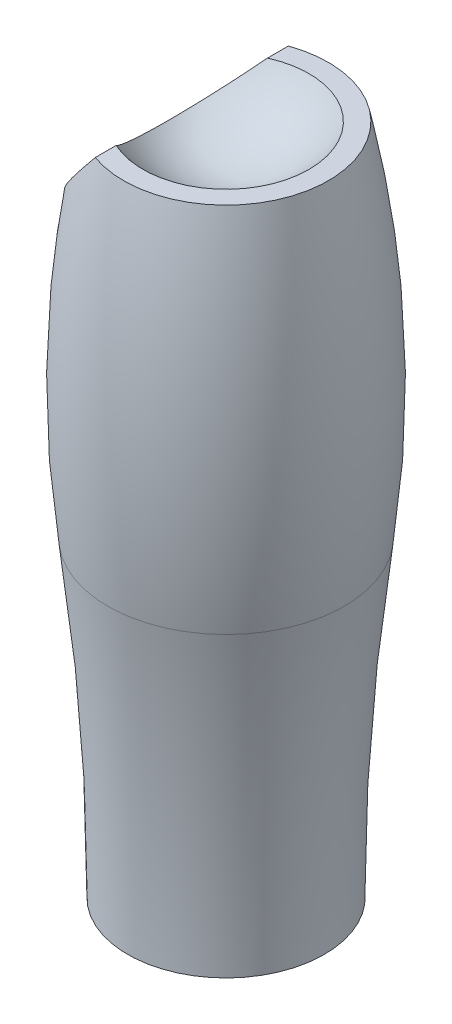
ISO-10303-21;
HEADER;
FILE_DESCRIPTION(('STEP AP214'),'2;1');
FILE_NAME('part.step','',(''),(''),'','','');
FILE_SCHEMA(('AUTOMOTIVE_DESIGN { 1 0 10303 214 1 1 1 1 }'));
ENDSEC;
DATA;
#1=APPLICATION_CONTEXT('core data for automotive mechanical design processes');
#2=APPLICATION_PROTOCOL_DEFINITION('international standard','automotive_design',2000,#1);
#3=PRODUCT_CONTEXT('',#1,'mechanical');
#4=PRODUCT('Part','Part','',(#3));
#5=PRODUCT_RELATED_PRODUCT_CATEGORY('part','',(#4));
#6=PRODUCT_DEFINITION_FORMATION('','',#4);
#7=PRODUCT_DEFINITION_CONTEXT('part definition',#1,'design');
#8=PRODUCT_DEFINITION('design','',#6,#7);
#9=PRODUCT_DEFINITION_SHAPE('','',#8);
#10=(LENGTH_UNIT() NAMED_UNIT(*) SI_UNIT(.MILLI.,.METRE.));
#11=(NAMED_UNIT(*) PLANE_ANGLE_UNIT() SI_UNIT($,.RADIAN.));
#12=(NAMED_UNIT(*) SI_UNIT($,.STERADIAN.) SOLID_ANGLE_UNIT());
#13=UNCERTAINTY_MEASURE_WITH_UNIT(LENGTH_MEASURE(1.E-05),#10,'distance_accuracy_value','');
#14=(GEOMETRIC_REPRESENTATION_CONTEXT(3) GLOBAL_UNCERTAINTY_ASSIGNED_CONTEXT((#13)) GLOBAL_UNIT_ASSIGNED_CONTEXT((#10,
#11,#12)) REPRESENTATION_CONTEXT('',''));
#15=CARTESIAN_POINT('',(0.,0.,0.));
#16=DIRECTION('',(0.,0.,1.));
#17=DIRECTION('',(1.,0.,0.));
#18=AXIS2_PLACEMENT_3D('',#15,#16,#17);
#19=CARTESIAN_POINT('',(0.,235.75,0.));
#20=DIRECTION('',(0.,1.,0.));
#21=DIRECTION('',(0.,0.,1.));
#22=AXIS2_PLACEMENT_3D('',#19,#20,#21);
#23=PLANE('',#22);
#24=CARTESIAN_POINT('',(0.,235.75,0.));
#25=DIRECTION('',(0.,-1.,0.));
#26=DIRECTION('',(0.,0.,-1.));
#27=AXIS2_PLACEMENT_3D('',#24,#25,#26);
#28=CIRCLE('',#27,35.9375);
#29=CARTESIAN_POINT('',(-11.9999999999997,235.75,-33.8748270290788));
#30=VERTEX_POINT('',#29);
#31=CARTESIAN_POINT('',(-11.9999999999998,235.75,33.8748270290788));
#32=VERTEX_POINT('',#31);
#33=EDGE_CURVE('E44',#30,#32,#28,.T.);
#34=ORIENTED_EDGE('',*,*,#33,.F.);
#35=DIRECTION('',(0.,0.,1.));
#36=VECTOR('',#35,1.);
#37=CARTESIAN_POINT('',(-11.9999999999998,235.75,0.));
#38=LINE('',#37,#36);
#39=CARTESIAN_POINT('',(-11.9999999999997,235.75,-26.5329983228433));
#40=VERTEX_POINT('',#39);
#41=EDGE_CURVE('E55',#30,#40,#38,.T.);
#42=ORIENTED_EDGE('',*,*,#41,.T.);
#43=CARTESIAN_POINT('',(0.,235.75,0.));
#44=DIRECTION('',(0.,1.,0.));
#45=DIRECTION('',(0.,0.,1.));
#46=AXIS2_PLACEMENT_3D('',#43,#44,#45);
#47=CIRCLE('',#46,29.1204395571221);
#48=CARTESIAN_POINT('',(-11.9999999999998,235.75,26.5329983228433));
#49=VERTEX_POINT('',#48);
#50=EDGE_CURVE('E66',#40,#49,#47,.F.);
#51=ORIENTED_EDGE('',*,*,#50,.T.);
#52=EDGE_CURVE('E51',#49,#32,#38,.T.);
#53=ORIENTED_EDGE('',*,*,#52,.T.);
#54=EDGE_LOOP('',(#34,#42,#51,#53));
#55=FACE_BOUND('',#54,.T.);
#56=ADVANCED_FACE('F36',(#55),#23,.T.);
#57=CARTESIAN_POINT('',(0.,156.489139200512,0.));
#58=DIRECTION('',(0.,-1.,0.));
#59=DIRECTION('',(0.,0.,-1.));
#60=AXIS2_PLACEMENT_3D('',#57,#58,#59);
#61=DEGENERATE_TOROIDAL_SURFACE('',#60,326.629953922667,371.129953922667,.F.);
#62=CARTESIAN_POINT('',(0.,109.25,0.));
#63=DIRECTION('',(0.,-1.,0.));
#64=DIRECTION('',(0.,0.,-1.));
#65=AXIS2_PLACEMENT_3D('',#62,#63,#64);
#66=CIRCLE('',#65,41.4813151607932);
#67=CARTESIAN_POINT('',(0.,109.25,-41.4813151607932));
#68=VERTEX_POINT('',#67);
#69=EDGE_CURVE('E75',#68,#68,#66,.T.);
#70=ORIENTED_EDGE('',*,*,#69,.F.);
#71=EDGE_LOOP('',(#70));
#72=FACE_BOUND('',#71,.T.);
#73=ORIENTED_EDGE('',*,*,#33,.T.);
#74=CARTESIAN_POINT('',(-11.9998321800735,235.7502,33.8748400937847));
#75=CARTESIAN_POINT('',(-12.6431995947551,234.983464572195,33.8247257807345));
#76=CARTESIAN_POINT('',(-13.2859511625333,234.21746308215,33.7548185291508));
#77=CARTESIAN_POINT('',(-14.5692010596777,232.688145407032,33.5747804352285));
#78=CARTESIAN_POINT('',(-15.209699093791,231.924829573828,33.4646445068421));
#79=CARTESIAN_POINT('',(-16.4888419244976,230.400406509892,33.2031997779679));
#80=CARTESIAN_POINT('',(-17.1274781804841,229.639309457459,33.0517895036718));
#81=CARTESIAN_POINT('',(-18.400049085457,228.122718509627,32.7070807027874));
#82=CARTESIAN_POINT('',(-19.0339839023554,227.367224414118,32.5137836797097));
#83=CARTESIAN_POINT('',(-20.3037547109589,225.853970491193,32.0815995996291));
#84=CARTESIAN_POINT('',(-20.9395147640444,225.096301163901,31.8421709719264));
#85=CARTESIAN_POINT('',(-22.2032862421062,223.590196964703,31.3181169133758));
#86=CARTESIAN_POINT('',(-22.8312979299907,222.841761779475,31.0334930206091));
#87=CARTESIAN_POINT('',(-24.0771886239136,221.356967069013,30.41794375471));
#88=CARTESIAN_POINT('',(-24.6950774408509,220.620595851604,30.0870665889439));
#89=CARTESIAN_POINT('',(-25.9192545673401,219.161678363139,29.3772568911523));
#90=CARTESIAN_POINT('',(-26.5255446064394,218.439130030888,28.9983315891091));
#91=CARTESIAN_POINT('',(-27.824479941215,216.891119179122,28.1231034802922));
#92=CARTESIAN_POINT('',(-28.5146279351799,216.068632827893,27.6177672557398));
#93=CARTESIAN_POINT('',(-29.8716348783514,214.451414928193,26.5361108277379));
#94=CARTESIAN_POINT('',(-30.5384938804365,213.656683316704,25.959790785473));
#95=CARTESIAN_POINT('',(-31.8413110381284,212.104046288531,24.7350272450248));
#96=CARTESIAN_POINT('',(-32.4773659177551,211.346025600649,24.0868338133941));
#97=CARTESIAN_POINT('',(-33.7143171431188,209.871884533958,22.7137298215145));
#98=CARTESIAN_POINT('',(-34.3152221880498,209.155753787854,21.9888383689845));
#99=CARTESIAN_POINT('',(-35.3406101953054,207.933743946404,20.6356187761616));
#100=CARTESIAN_POINT('',(-35.7738897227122,207.417381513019,20.0234103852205));
#101=CARTESIAN_POINT('',(-36.6105161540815,206.420328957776,18.751200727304));
#102=CARTESIAN_POINT('',(-37.0138639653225,205.939637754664,18.0912009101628));
#103=CARTESIAN_POINT('',(-37.7854104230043,205.020144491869,16.7236789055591));
#104=CARTESIAN_POINT('',(-38.1536336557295,204.581313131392,16.0161905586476));
#105=CARTESIAN_POINT('',(-38.6754451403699,203.959442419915,14.9201579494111));
#106=CARTESIAN_POINT('',(-38.8442867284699,203.758224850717,14.5490348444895));
#107=CARTESIAN_POINT('',(-39.1711402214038,203.368696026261,13.7952668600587));
#108=CARTESIAN_POINT('',(-39.329149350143,203.180388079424,13.4126190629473));
#109=CARTESIAN_POINT('',(-39.7221978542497,202.711971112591,12.4100127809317));
#110=CARTESIAN_POINT('',(-39.9484895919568,202.442287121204,11.7816639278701));
#111=CARTESIAN_POINT('',(-40.3686864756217,201.941515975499,10.4994190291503));
#112=CARTESIAN_POINT('',(-40.5625988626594,201.710420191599,9.84552873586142));
#113=CARTESIAN_POINT('',(-40.9149537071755,201.290500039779,8.51527819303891));
#114=CARTESIAN_POINT('',(-41.0734130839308,201.10165550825,7.83892883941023));
#115=CARTESIAN_POINT('',(-41.3521373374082,200.769484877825,6.46736207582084));
#116=CARTESIAN_POINT('',(-41.4724017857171,200.626159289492,5.77214445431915));
#117=CARTESIAN_POINT('',(-41.6729609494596,200.387142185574,4.36341553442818));
#118=CARTESIAN_POINT('',(-41.7530096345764,200.291743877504,3.64981905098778));
#119=CARTESIAN_POINT('',(-41.8703135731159,200.151946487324,2.21412447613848));
#120=CARTESIAN_POINT('',(-41.9075688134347,200.107547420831,1.49202638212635));
#121=CARTESIAN_POINT('',(-41.9384456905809,200.070749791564,0.0457236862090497));
#122=CARTESIAN_POINT('',(-41.9320765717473,200.078340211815,-0.678480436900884));
#123=CARTESIAN_POINT('',(-41.8758674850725,200.145327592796,-2.12275667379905));
#124=CARTESIAN_POINT('',(-41.8260298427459,200.204721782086,-2.84282900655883));
#125=CARTESIAN_POINT('',(-41.690617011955,200.366100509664,-4.20623034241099));
#126=CARTESIAN_POINT('',(-41.6087935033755,200.463613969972,-4.85047232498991));
#127=CARTESIAN_POINT('',(-41.411750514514,200.698440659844,-6.12638472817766));
#128=CARTESIAN_POINT('',(-41.2965342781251,200.835750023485,-6.75805636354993));
#129=CARTESIAN_POINT('',(-41.0345477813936,201.147973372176,-8.00543632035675));
#130=CARTESIAN_POINT('',(-40.8877707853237,201.322895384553,-8.62114120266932));
#131=CARTESIAN_POINT('',(-40.5648024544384,201.707794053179,-9.83370762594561));
#132=CARTESIAN_POINT('',(-40.3886053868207,201.917777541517,-10.4305654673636));
#133=CARTESIAN_POINT('',(-40.0737847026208,202.292966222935,-11.4033663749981));
#134=CARTESIAN_POINT('',(-39.9427887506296,202.449081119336,-11.7853466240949));
#135=CARTESIAN_POINT('',(-39.6697499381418,202.774476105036,-12.5394975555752));
#136=CARTESIAN_POINT('',(-39.5277095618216,202.943753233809,-12.9116704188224));
#137=CARTESIAN_POINT('',(-39.0858967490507,203.470285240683,-14.0132213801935));
#138=CARTESIAN_POINT('',(-38.7704608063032,203.846207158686,-14.7275455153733));
#139=CARTESIAN_POINT('',(-38.1028056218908,204.641887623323,-16.1144760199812));
#140=CARTESIAN_POINT('',(-37.7505367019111,205.061705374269,-16.7870240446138));
#141=CARTESIAN_POINT('',(-37.0143693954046,205.939035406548,-18.088697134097));
#142=CARTESIAN_POINT('',(-36.6304692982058,206.396549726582,-18.7178198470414));
#143=CARTESIAN_POINT('',(-35.6803738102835,207.528829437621,-20.1694854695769));
#144=CARTESIAN_POINT('',(-35.1014317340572,208.218785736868,-20.9718811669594));
#145=CARTESIAN_POINT('',(-33.9006658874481,209.649802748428,-22.494846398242));
#146=CARTESIAN_POINT('',(-33.2788259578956,210.390882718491,-23.2153848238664));
#147=CARTESIAN_POINT('',(-31.9994623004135,211.91556895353,-24.5784949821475));
#148=CARTESIAN_POINT('',(-31.3418821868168,212.699242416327,-25.2209380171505));
#149=CARTESIAN_POINT('',(-29.9985930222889,214.300112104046,-26.4298491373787));
#150=CARTESIAN_POINT('',(-29.3128843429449,215.117307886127,-26.9963182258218));
#151=CARTESIAN_POINT('',(-28.114801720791,216.545127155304,-27.9075273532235));
#152=CARTESIAN_POINT('',(-27.6078938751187,217.149236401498,-28.2698311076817));
#153=CARTESIAN_POINT('',(-26.583971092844,218.369500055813,-28.9581264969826));
#154=CARTESIAN_POINT('',(-26.0669552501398,218.985655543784,-29.2841148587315));
#155=CARTESIAN_POINT('',(-24.5026323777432,220.84994294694,-30.2094803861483));
#156=CARTESIAN_POINT('',(-23.4422633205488,222.113641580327,-30.7560976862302));
#157=CARTESIAN_POINT('',(-21.2974802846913,224.669694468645,-31.7159093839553));
#158=CARTESIAN_POINT('',(-20.2130711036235,225.962043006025,-32.1291301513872));
#159=CARTESIAN_POINT('',(-18.027971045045,228.566143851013,-32.8284374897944));
#160=CARTESIAN_POINT('',(-16.9272881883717,229.877886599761,-33.1145846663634));
#161=CARTESIAN_POINT('',(-15.1864061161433,231.952589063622,-33.4688119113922));
#162=CARTESIAN_POINT('',(-14.5495145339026,232.71160689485,-33.5778744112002));
#163=CARTESIAN_POINT('',(-13.2752440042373,234.230223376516,-33.7559816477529));
#164=CARTESIAN_POINT('',(-12.6378715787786,234.989814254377,-33.8251391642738));
#165=CARTESIAN_POINT('',(-11.9998321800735,235.7502,-33.8748400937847));
#166=B_SPLINE_CURVE_WITH_KNOTS('',3,(#74,#75,#76,#77,#78,#79,#80,#81,#82,#83,#84,#85,#86,#87,
#88,#89,#90,#91,#92,#93,#94,#95,#96,#97,#98,#99,#100,#101,#102,#103,#104,#105,#106,#107,#108,
#109,#110,#111,#112,#113,#114,#115,#116,#117,#118,#119,#120,#121,#122,#123,#124,#125,#126,#127,
#128,#129,#130,#131,#132,#133,#134,#135,#136,#137,#138,#139,#140,#141,#142,#143,#144,#145,#146,
#147,#148,#149,#150,#151,#152,#153,#154,#155,#156,#157,#158,#159,#160,#161,#162,#163,#164,#165),
.UNSPECIFIED.,.F.,.F.,(4,2,2,2,2,2,2,2,2,2,2,2,2,2,2,2,2,2,2,2,2,2,2,2,2,2,2,2,2,2,2,2,2,2,2,2,
2,2,2,2,2,2,2,2,2,4),(0.,3.00632001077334,6.01302023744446,9.02718022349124,12.0412320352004,
15.0930998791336,18.1448638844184,21.1934705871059,24.2416190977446,27.7990656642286,
31.3565041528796,34.9019322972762,38.4464792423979,41.176041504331,43.9055209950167,
46.6330756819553,47.9967048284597,49.3606821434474,51.5192306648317,53.6772958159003,
55.8343288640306,57.9913861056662,60.1614837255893,62.3315820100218,64.5012204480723,
66.6707428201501,68.6386421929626,70.6063504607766,72.5744790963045,74.5429916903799,
75.8413907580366,77.1394986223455,79.7360037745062,82.3360572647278,84.9362514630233,
88.5495719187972,92.1642609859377,95.7848283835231,99.4053479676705,102.008008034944,
104.610902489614,109.817793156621,115.023653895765,120.227029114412,123.216755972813,
126.19799132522),.UNSPECIFIED.);
#167=EDGE_CURVE('E68',#32,#30,#166,.T.);
#168=ORIENTED_EDGE('',*,*,#167,.T.);
#169=EDGE_LOOP('',(#73,#168));
#170=FACE_BOUND('',#169,.T.);
#171=ADVANCED_FACE('F87',(#72,#170),#61,.F.);
#172=CARTESIAN_POINT('',(0.,254.25,0.));
#173=DIRECTION('',(0.,-1.,0.));
#174=DIRECTION('',(-1.,0.,0.));
#175=AXIS2_PLACEMENT_3D('',#172,#173,#174);
#176=SPHERICAL_SURFACE('',#175,34.5);
#177=ORIENTED_EDGE('',*,*,#50,.F.);
#178=CARTESIAN_POINT('',(2.06758264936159,252.515092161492,0.));
#179=DIRECTION('',(-0.766044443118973,0.642787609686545,0.));
#180=DIRECTION('',(-0.642787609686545,-0.766044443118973,0.));
#181=AXIS2_PLACEMENT_3D('',#178,#179,#180);
#182=CIRCLE('',#181,34.3942611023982);
#183=EDGE_CURVE('E12',#40,#49,#182,.T.);
#184=ORIENTED_EDGE('',*,*,#183,.T.);
#185=EDGE_LOOP('',(#177,#184));
#186=FACE_BOUND('',#185,.T.);
#187=ADVANCED_FACE('F70',(#186),#176,.F.);
#188=CARTESIAN_POINT('',(34.5,0.,0.));
#189=DIRECTION('',(0.,-1.,0.));
#190=DIRECTION('',(0.,0.,-1.));
#191=AXIS2_PLACEMENT_3D('',#188,#189,#190);
#192=PLANE('',#191);
#193=CARTESIAN_POINT('',(0.,1.0511297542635E-13,0.));
#194=DIRECTION('',(0.,-1.,0.));
#195=DIRECTION('',(0.,0.,-1.));
#196=AXIS2_PLACEMENT_3D('',#193,#194,#195);
#197=CIRCLE('',#196,34.5);
#198=CARTESIAN_POINT('',(0.,1.0511297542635E-13,-34.5));
#199=VERTEX_POINT('',#198);
#200=EDGE_CURVE('E71',#199,#199,#197,.T.);
#201=ORIENTED_EDGE('',*,*,#200,.T.);
#202=EDGE_LOOP('',(#201));
#203=FACE_BOUND('',#202,.T.);
#204=CARTESIAN_POINT('',(0.,0.,0.));
#205=DIRECTION('',(0.,-1.,0.));
#206=DIRECTION('',(0.,0.,-1.));
#207=AXIS2_PLACEMENT_3D('',#204,#205,#206);
#208=CIRCLE('',#207,26.9548233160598);
#209=CARTESIAN_POINT('',(0.,0.,-26.9548233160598));
#210=VERTEX_POINT('',#209);
#211=EDGE_CURVE('E72',#210,#210,#208,.F.);
#212=ORIENTED_EDGE('',*,*,#211,.T.);
#213=EDGE_LOOP('',(#212));
#214=FACE_BOUND('',#213,.T.);
#215=ADVANCED_FACE('F38',(#203,#214),#192,.T.);
#216=CARTESIAN_POINT('',(0.,0.,0.));
#217=DIRECTION('',(0.,-1.,0.));
#218=DIRECTION('',(0.,0.,-1.));
#219=AXIS2_PLACEMENT_3D('',#216,#217,#218);
#220=TOROIDAL_SURFACE('',#219,892.812580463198,858.312580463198);
#221=ORIENTED_EDGE('',*,*,#69,.T.);
#222=EDGE_LOOP('',(#221));
#223=FACE_BOUND('',#222,.T.);
#224=ORIENTED_EDGE('',*,*,#200,.F.);
#225=EDGE_LOOP('',(#224));
#226=FACE_BOUND('',#225,.T.);
#227=ADVANCED_FACE('F96',(#223,#226),#220,.F.);
#228=CARTESIAN_POINT('',(0.,-9.99999999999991,0.));
#229=DIRECTION('',(0.,-1.,0.));
#230=DIRECTION('',(-1.,0.,0.));
#231=AXIS2_PLACEMENT_3D('',#228,#229,#230);
#232=SPHERICAL_SURFACE('',#231,28.75);
#233=ORIENTED_EDGE('',*,*,#211,.F.);
#234=EDGE_LOOP('',(#233));
#235=FACE_BOUND('',#234,.T.);
#236=ADVANCED_FACE('F93',(#235),#232,.F.);
#237=CARTESIAN_POINT('',(-123.126102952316,103.315067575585,0.));
#238=DIRECTION('',(-0.766044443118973,0.642787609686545,0.));
#239=DIRECTION('',(-0.642787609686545,-0.766044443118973,0.));
#240=AXIS2_PLACEMENT_3D('',#237,#238,#239);
#241=PLANE('',#240);
#242=ORIENTED_EDGE('',*,*,#167,.F.);
#243=ORIENTED_EDGE('',*,*,#52,.F.);
#244=ORIENTED_EDGE('',*,*,#183,.F.);
#245=ORIENTED_EDGE('',*,*,#41,.F.);
#246=EDGE_LOOP('',(#242,#243,#244,#245));
#247=FACE_BOUND('',#246,.T.);
#248=ADVANCED_FACE('F60',(#247),#241,.T.);
#249=CLOSED_SHELL('',(#56,#171,#187,#215,#227,#236,#248));
#250=MANIFOLD_SOLID_BREP('B2',#249);
#251=ADVANCED_BREP_SHAPE_REPRESENTATION('',(#18,#250),#14);
#252=SHAPE_DEFINITION_REPRESENTATION(#9,#251);
ENDSEC;
END-ISO-10303-21;
